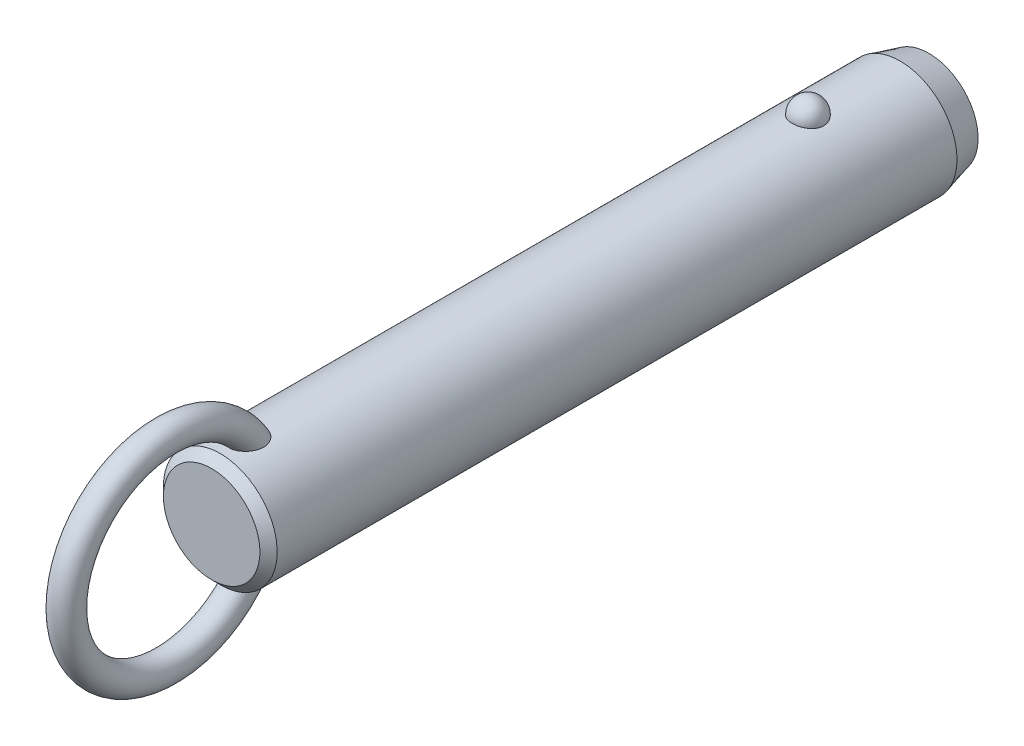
ISO-10303-21;
HEADER;
FILE_DESCRIPTION(('STEP AP214'),'2;1');
FILE_NAME('part.step','',(''),(''),'','','');
FILE_SCHEMA(('AUTOMOTIVE_DESIGN { 1 0 10303 214 1 1 1 1 }'));
ENDSEC;
DATA;
#1=APPLICATION_CONTEXT('core data for automotive mechanical design processes');
#2=APPLICATION_PROTOCOL_DEFINITION('international standard','automotive_design',2000,#1);
#3=PRODUCT_CONTEXT('',#1,'mechanical');
#4=PRODUCT('Part','Part','',(#3));
#5=PRODUCT_RELATED_PRODUCT_CATEGORY('part','',(#4));
#6=PRODUCT_DEFINITION_FORMATION('','',#4);
#7=PRODUCT_DEFINITION_CONTEXT('part definition',#1,'design');
#8=PRODUCT_DEFINITION('design','',#6,#7);
#9=PRODUCT_DEFINITION_SHAPE('','',#8);
#10=(LENGTH_UNIT() NAMED_UNIT(*) SI_UNIT(.MILLI.,.METRE.));
#11=(NAMED_UNIT(*) PLANE_ANGLE_UNIT() SI_UNIT($,.RADIAN.));
#12=(NAMED_UNIT(*) SI_UNIT($,.STERADIAN.) SOLID_ANGLE_UNIT());
#13=UNCERTAINTY_MEASURE_WITH_UNIT(LENGTH_MEASURE(1.E-05),#10,'distance_accuracy_value','');
#14=(GEOMETRIC_REPRESENTATION_CONTEXT(3) GLOBAL_UNCERTAINTY_ASSIGNED_CONTEXT((#13)) GLOBAL_UNIT_ASSIGNED_CONTEXT((#10,
#11,#12)) REPRESENTATION_CONTEXT('',''));
#15=CARTESIAN_POINT('',(0.,0.,0.));
#16=DIRECTION('',(0.,0.,1.));
#17=DIRECTION('',(1.,0.,0.));
#18=AXIS2_PLACEMENT_3D('',#15,#16,#17);
#19=CARTESIAN_POINT('',(0.,0.,71.1));
#20=DIRECTION('',(0.,0.,-1.));
#21=DIRECTION('',(-1.,0.,0.));
#22=AXIS2_PLACEMENT_3D('',#19,#20,#21);
#23=CYLINDRICAL_SURFACE('',#22,7.9);
#24=CARTESIAN_POINT('',(2.1785689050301,7.59367088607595,-2.19999999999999));
#25=CARTESIAN_POINT('',(2.17856679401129,7.59367269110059,-2.07701843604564));
#26=CARTESIAN_POINT('',(2.16853481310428,7.59657145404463,-1.95401006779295));
#27=CARTESIAN_POINT('',(2.12864689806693,7.607843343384,-1.71147811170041));
#28=CARTESIAN_POINT('',(2.09878338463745,7.61621856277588,-1.59195587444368));
#29=CARTESIAN_POINT('',(2.0199931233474,7.63749180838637,-1.3598563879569));
#30=CARTESIAN_POINT('',(1.97107475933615,7.6503878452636,-1.24727610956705));
#31=CARTESIAN_POINT('',(1.85539377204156,7.67926115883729,-1.03213234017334));
#32=CARTESIAN_POINT('',(1.78863158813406,7.69523835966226,-0.929568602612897));
#33=CARTESIAN_POINT('',(1.63856494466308,7.7285848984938,-0.736786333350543));
#34=CARTESIAN_POINT('',(1.55518140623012,7.7459606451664,-0.646630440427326));
#35=CARTESIAN_POINT('',(1.37422937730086,7.78009978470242,-0.481747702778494));
#36=CARTESIAN_POINT('',(1.27666086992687,7.79686317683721,-0.407020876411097));
#37=CARTESIAN_POINT('',(1.07024728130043,7.82786153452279,-0.275278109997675));
#38=CARTESIAN_POINT('',(0.961434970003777,7.84210353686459,-0.218212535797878));
#39=CARTESIAN_POINT('',(0.735351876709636,7.86652194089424,-0.123146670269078));
#40=CARTESIAN_POINT('',(0.618082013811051,7.87669878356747,-0.085144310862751));
#41=CARTESIAN_POINT('',(0.380637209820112,7.89170521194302,-0.0298158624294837));
#42=CARTESIAN_POINT('',(0.260550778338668,7.89662650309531,-0.0121347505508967));
#43=CARTESIAN_POINT('',(0.0190117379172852,7.90090003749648,0.00324379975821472));
#44=CARTESIAN_POINT('',(-0.102440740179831,7.90025280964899,0.00094313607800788));
#45=CARTESIAN_POINT('',(-0.341452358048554,7.89351056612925,-0.0233955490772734));
#46=CARTESIAN_POINT('',(-0.459042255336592,7.88749257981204,-0.0451545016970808));
#47=CARTESIAN_POINT('',(-0.688796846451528,7.87075812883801,-0.107408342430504));
#48=CARTESIAN_POINT('',(-0.800961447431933,7.86004158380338,-0.147903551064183));
#49=CARTESIAN_POINT('',(-1.01743634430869,7.83497131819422,-0.246799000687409));
#50=CARTESIAN_POINT('',(-1.12169791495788,7.82059709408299,-0.305300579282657));
#51=CARTESIAN_POINT('',(-1.31891765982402,7.78976470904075,-0.438549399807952));
#52=CARTESIAN_POINT('',(-1.41187469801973,7.77330633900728,-0.513298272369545));
#53=CARTESIAN_POINT('',(-1.58577142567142,7.73972434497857,-0.678622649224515));
#54=CARTESIAN_POINT('',(-1.66645140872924,7.72259402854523,-0.769470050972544));
#55=CARTESIAN_POINT('',(-1.81161503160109,7.68983776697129,-0.963538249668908));
#56=CARTESIAN_POINT('',(-1.87609753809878,7.6742119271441,-1.06675991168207));
#57=CARTESIAN_POINT('',(-1.98790138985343,7.6460202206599,-1.28401170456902));
#58=CARTESIAN_POINT('',(-2.03501994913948,7.63349104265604,-1.39815107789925));
#59=CARTESIAN_POINT('',(-2.10986724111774,7.6131449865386,-1.63301784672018));
#60=CARTESIAN_POINT('',(-2.1375965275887,7.60532797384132,-1.75374505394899));
#61=CARTESIAN_POINT('',(-2.17289256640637,7.5953195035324,-1.99782562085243));
#62=CARTESIAN_POINT('',(-2.18054294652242,7.59310471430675,-2.12116592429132));
#63=CARTESIAN_POINT('',(-2.17572919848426,7.59448538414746,-2.36741799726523));
#64=CARTESIAN_POINT('',(-2.1632656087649,7.59808068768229,-2.49032977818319));
#65=CARTESIAN_POINT('',(-2.11865035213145,7.61064035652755,-2.73161015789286));
#66=CARTESIAN_POINT('',(-2.08659579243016,7.61957823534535,-2.84999812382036));
#67=CARTESIAN_POINT('',(-2.00367799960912,7.64179982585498,-3.07955956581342));
#68=CARTESIAN_POINT('',(-1.9528140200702,7.65508371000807,-3.19073275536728));
#69=CARTESIAN_POINT('',(-1.83321113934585,7.68460381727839,-3.40337899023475));
#70=CARTESIAN_POINT('',(-1.76437735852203,7.70085556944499,-3.50479651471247));
#71=CARTESIAN_POINT('',(-1.61069526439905,7.73445734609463,-3.69446912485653));
#72=CARTESIAN_POINT('',(-1.52584634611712,7.75180741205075,-3.78272371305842));
#73=CARTESIAN_POINT('',(-1.34198059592,7.78574608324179,-3.94393987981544));
#74=CARTESIAN_POINT('',(-1.24291308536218,7.80233167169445,-4.01684434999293));
#75=CARTESIAN_POINT('',(-1.03352039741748,7.83281625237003,-4.14489386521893));
#76=CARTESIAN_POINT('',(-0.92319600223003,7.84671543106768,-4.20004014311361));
#77=CARTESIAN_POINT('',(-0.695822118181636,7.87011575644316,-4.29042017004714));
#78=CARTESIAN_POINT('',(-0.578872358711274,7.87966903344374,-4.32589112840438));
#79=CARTESIAN_POINT('',(-0.340410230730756,7.8935652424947,-4.37692226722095));
#80=CARTESIAN_POINT('',(-0.218898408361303,7.89790879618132,-4.39248482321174));
#81=CARTESIAN_POINT('',(0.0228107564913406,7.90087453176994,-4.40314405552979));
#82=CARTESIAN_POINT('',(0.142990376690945,7.89960185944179,-4.39861683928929));
#83=CARTESIAN_POINT('',(0.380829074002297,7.89171262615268,-4.37008293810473));
#84=CARTESIAN_POINT('',(0.498488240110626,7.8850962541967,-4.34607694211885));
#85=CARTESIAN_POINT('',(0.727535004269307,7.86726442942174,-4.27939317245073));
#86=CARTESIAN_POINT('',(0.838944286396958,7.85606616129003,-4.236785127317));
#87=CARTESIAN_POINT('',(1.05295421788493,7.83025654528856,-4.13408348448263));
#88=CARTESIAN_POINT('',(1.15555431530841,7.81564498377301,-4.07398879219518));
#89=CARTESIAN_POINT('',(1.35076763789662,7.7843022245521,-3.93687432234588));
#90=CARTESIAN_POINT('',(1.4432046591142,7.76754209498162,-3.85961036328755));
#91=CARTESIAN_POINT('',(1.6139111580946,7.73387857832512,-3.69076949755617));
#92=CARTESIAN_POINT('',(1.6921781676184,7.71697516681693,-3.59919010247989));
#93=CARTESIAN_POINT('',(1.83380875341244,7.6845643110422,-3.40247278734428));
#94=CARTESIAN_POINT('',(1.89689280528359,7.66908588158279,-3.29712873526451));
#95=CARTESIAN_POINT('',(2.0047823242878,7.64159441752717,-3.07707931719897));
#96=CARTESIAN_POINT('',(2.0495945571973,7.62958010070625,-2.96237743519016));
#97=CARTESIAN_POINT('',(2.11580183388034,7.61146617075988,-2.74040519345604));
#98=CARTESIAN_POINT('',(2.13929812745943,7.60484503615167,-2.63379846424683));
#99=CARTESIAN_POINT('',(2.17068242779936,7.59594664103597,-2.41813481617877));
#100=CARTESIAN_POINT('',(2.17857077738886,7.59366928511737,-2.30907795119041));
#101=CARTESIAN_POINT('',(2.1785689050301,7.59367088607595,-2.19999999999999));
#102=B_SPLINE_CURVE_WITH_KNOTS('',3,(#24,#25,#26,#27,#28,#29,#30,#31,#32,#33,#34,#35,#36,#37,
#38,#39,#40,#41,#42,#43,#44,#45,#46,#47,#48,#49,#50,#51,#52,#53,#54,#55,#56,#57,#58,#59,#60,#61,
#62,#63,#64,#65,#66,#67,#68,#69,#70,#71,#72,#73,#74,#75,#76,#77,#78,#79,#80,#81,#82,#83,#84,#85,
#86,#87,#88,#89,#90,#91,#92,#93,#94,#95,#96,#97,#98,#99,#100,#101),.UNSPECIFIED.,.T.,.F.,(4,2,2,
2,2,2,2,2,2,2,2,2,2,2,2,2,2,2,2,2,2,2,2,2,2,2,2,2,2,2,2,2,2,2,2,2,2,2,4),(0.,0.368552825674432,
0.737246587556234,1.10577831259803,1.4743009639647,1.8446206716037,2.21494081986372,
2.5842105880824,2.95344028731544,3.31611630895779,3.67875788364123,4.03628044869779,
4.39380913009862,4.75338791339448,5.11300280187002,5.47939989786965,5.8458226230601,
6.21639834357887,6.58696347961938,6.95598276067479,7.32499216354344,7.69218715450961,
8.0593967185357,8.42858578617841,8.79778880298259,9.16834203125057,9.5388695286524,
9.90482699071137,10.2707407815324,10.6298333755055,10.9889132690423,11.3466585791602,
11.7044262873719,12.0676511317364,12.4309391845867,12.8004764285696,13.1698767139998,
13.4967701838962,13.8236564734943),.UNSPECIFIED.);
#103=CARTESIAN_POINT('',(2.1785689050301,7.59367088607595,-2.19999999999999));
#104=VERTEX_POINT('',#103);
#105=EDGE_CURVE('E41',#104,#104,#102,.T.);
#106=ORIENTED_EDGE('',*,*,#105,.T.);
#107=EDGE_LOOP('',(#106));
#108=FACE_BOUND('',#107,.T.);
#109=CARTESIAN_POINT('',(0.,0.,79.42));
#110=DIRECTION('',(0.,0.,1.));
#111=DIRECTION('',(1.,0.,0.));
#112=AXIS2_PLACEMENT_3D('',#109,#110,#111);
#113=CIRCLE('',#112,7.9);
#114=CARTESIAN_POINT('',(-7.90000000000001,0.,79.42));
#115=VERTEX_POINT('',#114);
#116=EDGE_CURVE('E10',#115,#115,#113,.F.);
#117=ORIENTED_EDGE('',*,*,#116,.T.);
#118=EDGE_LOOP('',(#117));
#119=FACE_BOUND('',#118,.T.);
#120=CARTESIAN_POINT('',(-0.630969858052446,-7.87476203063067,73.3124322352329));
#121=CARTESIAN_POINT('',(-0.73418033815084,-7.8664899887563,73.347285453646));
#122=CARTESIAN_POINT('',(-0.834476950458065,-7.85639291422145,73.3908160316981));
#123=CARTESIAN_POINT('',(-1.02620356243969,-7.83366343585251,73.494094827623));
#124=CARTESIAN_POINT('',(-1.1176141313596,-7.82102565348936,73.5538775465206));
#125=CARTESIAN_POINT('',(-1.28877277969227,-7.79464922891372,73.6878390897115));
#126=CARTESIAN_POINT('',(-1.36854014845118,-7.78091246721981,73.761993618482));
#127=CARTESIAN_POINT('',(-1.5146152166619,-7.75380398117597,73.9224941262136));
#128=CARTESIAN_POINT('',(-1.58092966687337,-7.74043207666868,74.0088339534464));
#129=CARTESIAN_POINT('',(-1.70019064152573,-7.71512522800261,74.1929784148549));
#130=CARTESIAN_POINT('',(-1.75284037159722,-7.70322473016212,74.2909792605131));
#131=CARTESIAN_POINT('',(-1.84263464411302,-7.68224112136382,74.4941029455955));
#132=CARTESIAN_POINT('',(-1.87977299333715,-7.6731591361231,74.5992286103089));
#133=CARTESIAN_POINT('',(-1.94152728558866,-7.65777930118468,74.8232849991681));
#134=CARTESIAN_POINT('',(-1.96475471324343,-7.65179654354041,74.9426167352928));
#135=CARTESIAN_POINT('',(-1.99449499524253,-7.64409642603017,75.1834298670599));
#136=CARTESIAN_POINT('',(-2.0010005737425,-7.64238092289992,75.3049121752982));
#137=CARTESIAN_POINT('',(-1.99856014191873,-7.64302120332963,75.5683409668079));
#138=CARTESIAN_POINT('',(-1.98680021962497,-7.64611845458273,75.7102565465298));
#139=CARTESIAN_POINT('',(-1.94457772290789,-7.65696186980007,75.9911188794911));
#140=CARTESIAN_POINT('',(-1.91409393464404,-7.66471330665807,76.1300620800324));
#141=CARTESIAN_POINT('',(-1.82768670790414,-7.68582947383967,76.431939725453));
#142=CARTESIAN_POINT('',(-1.76772963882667,-7.70003779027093,76.593686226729));
#143=CARTESIAN_POINT('',(-1.65998501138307,-7.72371550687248,76.8276956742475));
#144=CARTESIAN_POINT('',(-1.621079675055,-7.73200670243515,76.9042974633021));
#145=CARTESIAN_POINT('',(-1.53727726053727,-7.74910377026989,77.0540798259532));
#146=CARTESIAN_POINT('',(-1.49238215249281,-7.75790947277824,77.1272615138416));
#147=CARTESIAN_POINT('',(-1.3739705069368,-7.77993338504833,77.3028838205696));
#148=CARTESIAN_POINT('',(-1.29690364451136,-7.79328473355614,77.4029557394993));
#149=CARTESIAN_POINT('',(-1.1288548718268,-7.81939266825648,77.5907147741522));
#150=CARTESIAN_POINT('',(-1.03789926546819,-7.83215032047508,77.6784247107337));
#151=CARTESIAN_POINT('',(-0.869532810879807,-7.85231710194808,77.8134148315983));
#152=CARTESIAN_POINT('',(-0.795716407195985,-7.86021093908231,77.865076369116));
#153=CARTESIAN_POINT('',(-0.64081313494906,-7.87434920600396,77.9563815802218));
#154=CARTESIAN_POINT('',(-0.55973779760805,-7.88059619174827,77.9960438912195));
#155=CARTESIAN_POINT('',(-0.406456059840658,-7.88984116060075,78.0543008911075));
#156=CARTESIAN_POINT('',(-0.335227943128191,-7.89321892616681,78.0753848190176));
#157=CARTESIAN_POINT('',(-0.19019307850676,-7.89804235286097,78.1054141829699));
#158=CARTESIAN_POINT('',(-0.11638863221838,-7.89948969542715,78.1143701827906));
#159=CARTESIAN_POINT('',(0.0318414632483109,-7.90028409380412,78.1192915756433));
#160=CARTESIAN_POINT('',(0.106268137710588,-7.89962640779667,78.1152276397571));
#161=CARTESIAN_POINT('',(0.253290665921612,-7.8962818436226,78.0944615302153));
#162=CARTESIAN_POINT('',(0.32588518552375,-7.8935935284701,78.0777504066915));
#163=CARTESIAN_POINT('',(0.481441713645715,-7.88577340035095,78.0287380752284));
#164=CARTESIAN_POINT('',(0.563611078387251,-7.88026321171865,77.994005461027));
#165=CARTESIAN_POINT('',(0.721129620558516,-7.86741729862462,77.9117965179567));
#166=CARTESIAN_POINT('',(0.796466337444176,-7.86007832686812,77.864297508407));
#167=CARTESIAN_POINT('',(0.971456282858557,-7.84073285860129,77.736513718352));
#168=CARTESIAN_POINT('',(1.0671968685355,-7.82809461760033,77.6510047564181));
#169=CARTESIAN_POINT('',(1.24418921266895,-7.80192439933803,77.466232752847));
#170=CARTESIAN_POINT('',(1.32540832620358,-7.78839049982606,77.3669395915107));
#171=CARTESIAN_POINT('',(1.45199971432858,-7.76559693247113,77.1895760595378));
#172=CARTESIAN_POINT('',(1.50085649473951,-7.75626094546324,77.1139542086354));
#173=CARTESIAN_POINT('',(1.59197749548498,-7.7380727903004,76.9587428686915));
#174=CARTESIAN_POINT('',(1.63423919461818,-7.72922080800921,76.8791518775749));
#175=CARTESIAN_POINT('',(1.71222612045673,-7.71231959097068,76.7166640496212));
#176=CARTESIAN_POINT('',(1.74794516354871,-7.70427111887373,76.6337641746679));
#177=CARTESIAN_POINT('',(1.81270113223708,-7.68929240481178,76.4652967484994));
#178=CARTESIAN_POINT('',(1.84173789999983,-7.68236218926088,76.3797291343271));
#179=CARTESIAN_POINT('',(1.89322698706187,-7.66983757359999,76.2052870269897));
#180=CARTESIAN_POINT('',(1.91558744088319,-7.66426199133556,76.1163838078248));
#181=CARTESIAN_POINT('',(1.95281367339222,-7.65485915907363,75.9369696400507));
#182=CARTESIAN_POINT('',(1.96767946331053,-7.65103190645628,75.8464586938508));
#183=CARTESIAN_POINT('',(2.00021456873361,-7.64262981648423,75.5737320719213));
#184=CARTESIAN_POINT('',(2.00600691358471,-7.6410871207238,75.3897099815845));
#185=CARTESIAN_POINT('',(1.98445334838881,-7.64669564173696,75.0765019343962));
#186=CARTESIAN_POINT('',(1.96607186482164,-7.65149688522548,74.9466189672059));
#187=CARTESIAN_POINT('',(1.90884967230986,-7.6659762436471,74.6916321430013));
#188=CARTESIAN_POINT('',(1.8700210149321,-7.67565148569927,74.566525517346));
#189=CARTESIAN_POINT('',(1.77063986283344,-7.69918471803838,74.3245401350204));
#190=CARTESIAN_POINT('',(1.70993724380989,-7.71307150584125,74.2077250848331));
#191=CARTESIAN_POINT('',(1.5673307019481,-7.74330306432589,73.9881444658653));
#192=CARTESIAN_POINT('',(1.48543692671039,-7.75964665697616,73.8853722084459));
#193=CARTESIAN_POINT('',(1.31346177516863,-7.79047523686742,73.7093800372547));
#194=CARTESIAN_POINT('',(1.22547278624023,-7.80495298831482,73.6341066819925));
#195=CARTESIAN_POINT('',(1.03724352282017,-7.83218597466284,73.5004864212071));
#196=CARTESIAN_POINT('',(0.937008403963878,-7.84494192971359,73.4421324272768));
#197=CARTESIAN_POINT('',(0.733599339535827,-7.86649045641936,73.3470270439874));
#198=CARTESIAN_POINT('',(0.630941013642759,-7.87547134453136,73.3092109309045));
#199=CARTESIAN_POINT('',(0.420465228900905,-7.88950708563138,73.2511160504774));
#200=CARTESIAN_POINT('',(0.312645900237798,-7.89456050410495,73.2308436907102));
#201=CARTESIAN_POINT('',(0.0960869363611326,-7.9001518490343,73.2084559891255));
#202=CARTESIAN_POINT('',(-0.0126341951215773,-7.90073226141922,73.2061698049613));
#203=CARTESIAN_POINT('',(-0.228766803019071,-7.89742350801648,73.2193678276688));
#204=CARTESIAN_POINT('',(-0.336180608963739,-7.89354403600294,73.2348134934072));
#205=CARTESIAN_POINT('',(-0.473410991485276,-7.88586871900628,73.2662177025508));
#206=CARTESIAN_POINT('',(-0.50525779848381,-7.88388984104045,73.2743541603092));
#207=CARTESIAN_POINT('',(-0.5684812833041,-7.87958326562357,73.2922083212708));
#208=CARTESIAN_POINT('',(-0.599857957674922,-7.87725556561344,73.3019260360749));
#209=CARTESIAN_POINT('',(-0.630969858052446,-7.87476203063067,73.3124322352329));
#210=B_SPLINE_CURVE_WITH_KNOTS('',3,(#120,#121,#122,#123,#124,#125,#126,#127,#128,#129,#130,
#131,#132,#133,#134,#135,#136,#137,#138,#139,#140,#141,#142,#143,#144,#145,#146,#147,#148,#149,
#150,#151,#152,#153,#154,#155,#156,#157,#158,#159,#160,#161,#162,#163,#164,#165,#166,#167,#168,
#169,#170,#171,#172,#173,#174,#175,#176,#177,#178,#179,#180,#181,#182,#183,#184,#185,#186,#187,
#188,#189,#190,#191,#192,#193,#194,#195,#196,#197,#198,#199,#200,#201,#202,#203,#204,#205,#206,
#207,#208,#209),.UNSPECIFIED.,.T.,.F.,(4,2,2,2,2,2,2,2,2,2,2,2,2,2,2,2,2,2,2,2,2,2,2,2,2,2,2,2,
2,2,2,2,2,2,2,2,2,2,2,2,2,2,2,2,4),(0.,0.327622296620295,0.655945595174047,0.983718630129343,
1.3113267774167,1.64554655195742,1.9798996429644,2.3436572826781,2.70757317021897,
3.13333684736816,3.55958380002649,4.07655306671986,4.3352789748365,4.59391999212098,
4.97382437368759,5.35301797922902,5.62348245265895,5.89352465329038,6.11565959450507,
6.3376009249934,6.56004255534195,6.78264174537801,7.04930844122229,7.31645206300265,
7.70130871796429,8.08701995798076,8.35824509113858,8.62957365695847,8.90115735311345,
9.17274746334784,9.44791855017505,9.72308922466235,10.2715298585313,10.6638393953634,
11.0559179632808,11.4507403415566,11.845374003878,12.1936425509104,12.5417649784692,
12.8695063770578,13.1973674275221,13.5221104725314,13.8461490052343,13.9449071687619,
14.0436660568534),.UNSPECIFIED.);
#211=CARTESIAN_POINT('',(-0.630969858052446,-7.87476203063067,73.3124322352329));
#212=VERTEX_POINT('',#211);
#213=EDGE_CURVE('E59',#212,#212,#210,.T.);
#214=ORIENTED_EDGE('',*,*,#213,.T.);
#215=EDGE_LOOP('',(#214));
#216=FACE_BOUND('',#215,.T.);
#217=CARTESIAN_POINT('',(-0.630969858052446,7.87476203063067,73.3124322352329));
#218=CARTESIAN_POINT('',(-0.528918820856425,7.88293636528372,73.2779798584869));
#219=CARTESIAN_POINT('',(-0.423745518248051,7.8893481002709,73.251915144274));
#220=CARTESIAN_POINT('',(-0.210236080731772,7.8979273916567,73.2172825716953));
#221=CARTESIAN_POINT('',(-0.10189380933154,7.90008607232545,73.2087513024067));
#222=CARTESIAN_POINT('',(0.114660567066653,7.89990877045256,73.2094570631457));
#223=CARTESIAN_POINT('',(0.222872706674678,7.89757640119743,73.2186798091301));
#224=CARTESIAN_POINT('',(0.436107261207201,7.88867538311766,73.2546525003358));
#225=CARTESIAN_POINT('',(0.541131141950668,7.8821087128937,73.2813942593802));
#226=CARTESIAN_POINT('',(0.745085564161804,7.86545130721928,73.3517561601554));
#227=CARTESIAN_POINT('',(0.844015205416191,7.85536005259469,73.3953787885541));
#228=CARTESIAN_POINT('',(1.03299167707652,7.83275153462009,73.4983796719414));
#229=CARTESIAN_POINT('',(1.12303841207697,7.8202342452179,73.5577580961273));
#230=CARTESIAN_POINT('',(1.29214734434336,7.79408219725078,73.6908647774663));
#231=CARTESIAN_POINT('',(1.37116907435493,7.78044359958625,73.7646436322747));
#232=CARTESIAN_POINT('',(1.51597677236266,7.75353170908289,73.9242353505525));
#233=CARTESIAN_POINT('',(1.58176261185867,7.74025841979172,74.0100483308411));
#234=CARTESIAN_POINT('',(1.70057386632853,7.71504069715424,74.193644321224));
#235=CARTESIAN_POINT('',(1.75320073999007,7.70314257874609,74.2916906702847));
#236=CARTESIAN_POINT('',(1.84293767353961,7.68216822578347,74.4948931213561));
#237=CARTESIAN_POINT('',(1.88004278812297,7.67309289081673,74.6000514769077));
#238=CARTESIAN_POINT('',(1.9417232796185,7.6577294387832,74.8241671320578));
#239=CARTESIAN_POINT('',(1.96491037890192,7.65175648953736,74.9435248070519));
#240=CARTESIAN_POINT('',(1.9945689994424,7.64407702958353,75.1843848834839));
#241=CARTESIAN_POINT('',(2.00103304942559,7.64237242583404,75.3058882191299));
#242=CARTESIAN_POINT('',(1.9985016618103,7.64303650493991,75.5693688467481));
#243=CARTESIAN_POINT('',(1.98669038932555,7.64614714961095,75.7113141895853));
#244=CARTESIAN_POINT('',(1.94436120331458,7.6570170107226,75.9922287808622));
#245=CARTESIAN_POINT('',(1.91382203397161,7.66478150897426,76.1311944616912));
#246=CARTESIAN_POINT('',(1.82728754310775,7.68592483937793,76.4331110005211));
#247=CARTESIAN_POINT('',(1.76725778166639,7.7001468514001,76.594872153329));
#248=CARTESIAN_POINT('',(1.65939700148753,7.72384204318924,76.8288914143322));
#249=CARTESIAN_POINT('',(1.62045187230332,7.73213852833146,76.9054942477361));
#250=CARTESIAN_POINT('',(1.53656684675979,7.74924489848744,77.0552737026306));
#251=CARTESIAN_POINT('',(1.49162892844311,7.75805461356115,77.1284514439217));
#252=CARTESIAN_POINT('',(1.37317698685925,7.78007342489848,77.3039520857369));
#253=CARTESIAN_POINT('',(1.29612360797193,7.79341423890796,77.4039112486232));
#254=CARTESIAN_POINT('',(1.12812043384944,7.81949839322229,77.5914508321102));
#255=CARTESIAN_POINT('',(1.03719688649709,7.83224280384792,77.6790540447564));
#256=CARTESIAN_POINT('',(0.868871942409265,7.85239026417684,77.8138971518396));
#257=CARTESIAN_POINT('',(0.795056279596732,7.86027769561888,77.8655113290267));
#258=CARTESIAN_POINT('',(0.640160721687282,7.87440222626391,77.9567201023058));
#259=CARTESIAN_POINT('',(0.559092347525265,7.88064188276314,77.9963333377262));
#260=CARTESIAN_POINT('',(0.405820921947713,7.8898738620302,78.0545056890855));
#261=CARTESIAN_POINT('',(0.334594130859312,7.89324577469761,78.0755523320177));
#262=CARTESIAN_POINT('',(0.189568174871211,7.89805733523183,78.1055070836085));
#263=CARTESIAN_POINT('',(0.115771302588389,7.89949866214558,78.1144257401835));
#264=CARTESIAN_POINT('',(-0.0324359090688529,7.90028156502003,78.1192758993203));
#265=CARTESIAN_POINT('',(-0.106847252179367,7.89961843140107,78.1151782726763));
#266=CARTESIAN_POINT('',(-0.253834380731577,7.8962642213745,78.0943519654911));
#267=CARTESIAN_POINT('',(-0.326408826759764,7.89357170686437,78.0776143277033));
#268=CARTESIAN_POINT('',(-0.481962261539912,7.88574179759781,78.0285391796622));
#269=CARTESIAN_POINT('',(-0.564145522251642,7.88022507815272,77.9937638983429));
#270=CARTESIAN_POINT('',(-0.721685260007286,7.86736646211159,77.9114686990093));
#271=CARTESIAN_POINT('',(-0.797029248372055,7.8600213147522,77.8639260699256));
#272=CARTESIAN_POINT('',(-0.972044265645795,7.84066026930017,77.7360267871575));
#273=CARTESIAN_POINT('',(-1.06779803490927,7.82801274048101,77.6504436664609));
#274=CARTESIAN_POINT('',(-1.24480531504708,7.80182621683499,77.4655223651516));
#275=CARTESIAN_POINT('',(-1.32602618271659,7.78828530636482,77.3661540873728));
#276=CARTESIAN_POINT('',(-1.45259834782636,7.76548487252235,77.1886806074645));
#277=CARTESIAN_POINT('',(-1.50143856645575,7.75614818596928,77.1130252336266));
#278=CARTESIAN_POINT('',(-1.59252410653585,7.73796020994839,76.9577484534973));
#279=CARTESIAN_POINT('',(-1.63476690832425,7.72910910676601,76.8781255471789));
#280=CARTESIAN_POINT('',(-1.71271318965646,7.71221133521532,76.7155750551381));
#281=CARTESIAN_POINT('',(-1.74841047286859,7.70416543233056,76.6326444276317));
#282=CARTESIAN_POINT('',(-1.81311929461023,7.6891937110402,76.4641168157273));
#283=CARTESIAN_POINT('',(-1.84213067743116,7.6822679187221,76.3785197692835));
#284=CARTESIAN_POINT('',(-1.89356259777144,7.66975461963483,76.2040254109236));
#285=CARTESIAN_POINT('',(-1.91589165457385,7.66418586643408,76.1150995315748));
#286=CARTESIAN_POINT('',(-1.95305070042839,7.65479859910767,75.9356424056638));
#287=CARTESIAN_POINT('',(-1.96788069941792,7.65098008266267,75.8451111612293));
#288=CARTESIAN_POINT('',(-2.00030078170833,7.64260704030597,75.5723270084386));
#289=CARTESIAN_POINT('',(-2.00600576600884,7.64108760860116,75.3882718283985));
#290=CARTESIAN_POINT('',(-1.98428483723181,7.64673945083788,75.0750800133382));
#291=CARTESIAN_POINT('',(-1.96583698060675,7.6515575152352,74.9452400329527));
#292=CARTESIAN_POINT('',(-1.90848948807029,7.66606613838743,74.6903619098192));
#293=CARTESIAN_POINT('',(-1.86960376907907,7.67575338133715,74.565320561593));
#294=CARTESIAN_POINT('',(-1.7701342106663,7.69930132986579,74.3235009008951));
#295=CARTESIAN_POINT('',(-1.70940488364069,7.71318991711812,74.2067844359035));
#296=CARTESIAN_POINT('',(-1.56672953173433,7.74342495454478,73.9873404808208));
#297=CARTESIAN_POINT('',(-1.48478316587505,7.75977144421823,73.8846132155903));
#298=CARTESIAN_POINT('',(-1.31266325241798,7.79061163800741,73.708643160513));
#299=CARTESIAN_POINT('',(-1.22456383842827,7.80509908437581,73.6333589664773));
#300=CARTESIAN_POINT('',(-1.03622400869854,7.83231881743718,73.4998659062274));
#301=CARTESIAN_POINT('',(-0.936015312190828,7.84505551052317,73.4416137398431));
#302=CARTESIAN_POINT('',(-0.798824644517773,7.85957802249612,73.3775408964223));
#303=CARTESIAN_POINT('',(-0.765787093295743,7.86286821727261,73.3632248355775));
#304=CARTESIAN_POINT('',(-0.698939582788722,7.86909211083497,73.336436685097));
#305=CARTESIAN_POINT('',(-0.66512963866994,7.8720258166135,73.3239645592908));
#306=CARTESIAN_POINT('',(-0.630969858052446,7.87476203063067,73.3124322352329));
#307=B_SPLINE_CURVE_WITH_KNOTS('',3,(#217,#218,#219,#220,#221,#222,#223,#224,#225,#226,#227,
#228,#229,#230,#231,#232,#233,#234,#235,#236,#237,#238,#239,#240,#241,#242,#243,#244,#245,#246,
#247,#248,#249,#250,#251,#252,#253,#254,#255,#256,#257,#258,#259,#260,#261,#262,#263,#264,#265,
#266,#267,#268,#269,#270,#271,#272,#273,#274,#275,#276,#277,#278,#279,#280,#281,#282,#283,#284,
#285,#286,#287,#288,#289,#290,#291,#292,#293,#294,#295,#296,#297,#298,#299,#300,#301,#302,#303,
#304,#305,#306),.UNSPECIFIED.,.T.,.F.,(4,2,2,2,2,2,2,2,2,2,2,2,2,2,2,2,2,2,2,2,2,2,2,2,2,2,2,2,
2,2,2,2,2,2,2,2,2,2,2,2,2,2,2,2,4),(0.,0.323920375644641,0.648516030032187,0.97285063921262,
1.29703380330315,1.62126473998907,1.94549915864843,2.27089401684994,2.5962920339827,
2.93059633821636,3.26500707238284,3.62881644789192,3.99278833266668,4.41865421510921,
4.84500434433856,5.36209210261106,5.62087589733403,5.87957448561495,6.25918598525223,
6.63808782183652,6.90846748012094,7.17842501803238,7.40052350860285,7.62242871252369,
7.84483086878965,8.06739077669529,8.33414615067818,8.60137921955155,8.98641454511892,
9.3723041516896,9.64358673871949,9.91497268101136,10.1866142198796,10.4582620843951,
10.7334745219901,11.0086865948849,11.5572126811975,11.9494246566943,12.3413699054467,
12.7359755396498,13.1305875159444,13.4791770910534,13.82687259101,13.9353013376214,
14.0437279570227),.UNSPECIFIED.);
#308=CARTESIAN_POINT('',(-0.630969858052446,7.87476203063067,73.3124322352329));
#309=VERTEX_POINT('',#308);
#310=EDGE_CURVE('E66',#309,#309,#307,.T.);
#311=ORIENTED_EDGE('',*,*,#310,.T.);
#312=EDGE_LOOP('',(#311));
#313=FACE_BOUND('',#312,.T.);
#314=CARTESIAN_POINT('',(0.,0.,-14.9999999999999));
#315=DIRECTION('',(0.,0.,-1.));
#316=DIRECTION('',(-1.,0.,0.));
#317=AXIS2_PLACEMENT_3D('',#314,#315,#316);
#318=CIRCLE('',#317,7.9);
#319=CARTESIAN_POINT('',(-7.9,0.,-14.9999999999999));
#320=VERTEX_POINT('',#319);
#321=EDGE_CURVE('E56',#320,#320,#318,.F.);
#322=ORIENTED_EDGE('',*,*,#321,.T.);
#323=EDGE_LOOP('',(#322));
#324=FACE_BOUND('',#323,.T.);
#325=ADVANCED_FACE('F37',(#108,#119,#216,#313,#324),#23,.T.);
#326=CARTESIAN_POINT('',(0.,0.,-19.));
#327=DIRECTION('',(0.,0.,-1.));
#328=DIRECTION('',(-1.,0.,0.));
#329=AXIS2_PLACEMENT_3D('',#326,#327,#328);
#330=PLANE('',#329);
#331=CARTESIAN_POINT('',(0.,0.,-19.));
#332=DIRECTION('',(0.,0.,-1.));
#333=DIRECTION('',(-1.,0.,0.));
#334=AXIS2_PLACEMENT_3D('',#331,#332,#333);
#335=CIRCLE('',#334,6.82820323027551);
#336=CARTESIAN_POINT('',(-6.82820323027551,0.,-19.));
#337=VERTEX_POINT('',#336);
#338=EDGE_CURVE('E65',#337,#337,#335,.T.);
#339=ORIENTED_EDGE('',*,*,#338,.T.);
#340=EDGE_LOOP('',(#339));
#341=FACE_BOUND('',#340,.T.);
#342=ADVANCED_FACE('F84',(#341),#330,.T.);
#343=CARTESIAN_POINT('',(0.,0.,-19.));
#344=DIRECTION('',(0.,0.,1.));
#345=DIRECTION('',(1.,0.,0.));
#346=AXIS2_PLACEMENT_3D('',#343,#344,#345);
#347=CONICAL_SURFACE('',#346,6.82820323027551,0.261799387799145);
#348=ORIENTED_EDGE('',*,*,#321,.F.);
#349=EDGE_LOOP('',(#348));
#350=FACE_BOUND('',#349,.T.);
#351=ORIENTED_EDGE('',*,*,#338,.F.);
#352=EDGE_LOOP('',(#351));
#353=FACE_BOUND('',#352,.T.);
#354=ADVANCED_FACE('F82',(#350,#353),#347,.T.);
#355=CARTESIAN_POINT('',(0.,0.,80.62));
#356=DIRECTION('',(0.,0.,1.));
#357=DIRECTION('',(1.,0.,0.));
#358=AXIS2_PLACEMENT_3D('',#355,#356,#357);
#359=PLANE('',#358);
#360=CARTESIAN_POINT('',(0.,0.,80.62));
#361=DIRECTION('',(0.,0.,1.));
#362=DIRECTION('',(1.,0.,0.));
#363=AXIS2_PLACEMENT_3D('',#360,#361,#362);
#364=CIRCLE('',#363,6.69999999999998);
#365=CARTESIAN_POINT('',(-6.69999999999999,0.,80.62));
#366=VERTEX_POINT('',#365);
#367=EDGE_CURVE('E50',#366,#366,#364,.T.);
#368=ORIENTED_EDGE('',*,*,#367,.T.);
#369=EDGE_LOOP('',(#368));
#370=FACE_BOUND('',#369,.T.);
#371=ADVANCED_FACE('F76',(#370),#359,.T.);
#372=CARTESIAN_POINT('',(0.,0.,86.95));
#373=DIRECTION('',(1.,0.,0.));
#374=DIRECTION('',(0.,0.,-1.));
#375=AXIS2_PLACEMENT_3D('',#372,#373,#374);
#376=TOROIDAL_SURFACE('',#375,13.85,2.);
#377=ORIENTED_EDGE('',*,*,#310,.F.);
#378=EDGE_LOOP('',(#377));
#379=FACE_BOUND('',#378,.T.);
#380=ORIENTED_EDGE('',*,*,#213,.F.);
#381=EDGE_LOOP('',(#380));
#382=FACE_BOUND('',#381,.T.);
#383=ADVANCED_FACE('F72',(#379,#382),#376,.T.);
#384=CARTESIAN_POINT('',(0.,0.,80.62));
#385=DIRECTION('',(0.,0.,-1.));
#386=DIRECTION('',(-1.,0.,0.));
#387=AXIS2_PLACEMENT_3D('',#384,#385,#386);
#388=CONICAL_SURFACE('',#387,6.69999999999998,0.785398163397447);
#389=CARTESIAN_POINT('',(-7.90000000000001,0.,79.42));
#390=CARTESIAN_POINT('',(-7.88750000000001,0.,79.4325));
#391=CARTESIAN_POINT('',(-7.87500000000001,0.,79.445));
#392=CARTESIAN_POINT('',(-7.85,0.,79.47));
#393=CARTESIAN_POINT('',(-7.8375,0.,79.4825));
#394=CARTESIAN_POINT('',(-7.81250000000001,0.,79.5075));
#395=CARTESIAN_POINT('',(-7.80000000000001,0.,79.52));
#396=CARTESIAN_POINT('',(-7.77500000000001,0.,79.545));
#397=CARTESIAN_POINT('',(-7.76250000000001,0.,79.5575));
#398=CARTESIAN_POINT('',(-7.7375,0.,79.5825));
#399=CARTESIAN_POINT('',(-7.725,0.,79.595));
#400=CARTESIAN_POINT('',(-7.7,0.,79.62));
#401=CARTESIAN_POINT('',(-7.68750000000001,0.,79.6325));
#402=CARTESIAN_POINT('',(-7.66250000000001,0.,79.6575));
#403=CARTESIAN_POINT('',(-7.65,0.,79.67));
#404=CARTESIAN_POINT('',(-7.625,0.,79.695));
#405=CARTESIAN_POINT('',(-7.6125,0.,79.7075));
#406=CARTESIAN_POINT('',(-7.5875,0.,79.7325));
#407=CARTESIAN_POINT('',(-7.575,0.,79.745));
#408=CARTESIAN_POINT('',(-7.55,0.,79.77));
#409=CARTESIAN_POINT('',(-7.5375,0.,79.7825));
#410=CARTESIAN_POINT('',(-7.5125,0.,79.8075));
#411=CARTESIAN_POINT('',(-7.5,0.,79.82));
#412=CARTESIAN_POINT('',(-7.475,0.,79.845));
#413=CARTESIAN_POINT('',(-7.4625,0.,79.8575));
#414=CARTESIAN_POINT('',(-7.4375,0.,79.8825));
#415=CARTESIAN_POINT('',(-7.425,0.,79.895));
#416=CARTESIAN_POINT('',(-7.4,0.,79.92));
#417=CARTESIAN_POINT('',(-7.3875,0.,79.9325));
#418=CARTESIAN_POINT('',(-7.3625,0.,79.9575));
#419=CARTESIAN_POINT('',(-7.35,0.,79.97));
#420=CARTESIAN_POINT('',(-7.325,0.,79.995));
#421=CARTESIAN_POINT('',(-7.3125,0.,80.0075));
#422=CARTESIAN_POINT('',(-7.2875,0.,80.0325));
#423=CARTESIAN_POINT('',(-7.275,0.,80.045));
#424=CARTESIAN_POINT('',(-7.25,0.,80.07));
#425=CARTESIAN_POINT('',(-7.2375,0.,80.0825));
#426=CARTESIAN_POINT('',(-7.2125,0.,80.1075));
#427=CARTESIAN_POINT('',(-7.2,0.,80.12));
#428=CARTESIAN_POINT('',(-7.175,0.,80.145));
#429=CARTESIAN_POINT('',(-7.1625,0.,80.1575));
#430=CARTESIAN_POINT('',(-7.1375,0.,80.1825));
#431=CARTESIAN_POINT('',(-7.125,0.,80.195));
#432=CARTESIAN_POINT('',(-7.1,0.,80.22));
#433=CARTESIAN_POINT('',(-7.0875,0.,80.2325));
#434=CARTESIAN_POINT('',(-7.06249999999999,0.,80.2575));
#435=CARTESIAN_POINT('',(-7.04999999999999,0.,80.27));
#436=CARTESIAN_POINT('',(-7.02499999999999,0.,80.295));
#437=CARTESIAN_POINT('',(-7.0125,0.,80.3075));
#438=CARTESIAN_POINT('',(-6.9875,0.,80.3325));
#439=CARTESIAN_POINT('',(-6.975,0.,80.345));
#440=CARTESIAN_POINT('',(-6.94999999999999,0.,80.37));
#441=CARTESIAN_POINT('',(-6.93749999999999,0.,80.3825));
#442=CARTESIAN_POINT('',(-6.91249999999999,0.,80.4075));
#443=CARTESIAN_POINT('',(-6.9,0.,80.42));
#444=CARTESIAN_POINT('',(-6.87499999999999,0.,80.445));
#445=CARTESIAN_POINT('',(-6.86249999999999,0.,80.4575));
#446=CARTESIAN_POINT('',(-6.83749999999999,0.,80.4825));
#447=CARTESIAN_POINT('',(-6.82499999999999,0.,80.495));
#448=CARTESIAN_POINT('',(-6.79999999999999,0.,80.52));
#449=CARTESIAN_POINT('',(-6.78749999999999,0.,80.5325));
#450=CARTESIAN_POINT('',(-6.76249999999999,0.,80.5575));
#451=CARTESIAN_POINT('',(-6.74999999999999,0.,80.57));
#452=CARTESIAN_POINT('',(-6.72499999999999,0.,80.595));
#453=CARTESIAN_POINT('',(-6.71249999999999,0.,80.6075));
#454=CARTESIAN_POINT('',(-6.69999999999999,0.,80.62));
#455=B_SPLINE_CURVE_WITH_KNOTS('',3,(#389,#390,#391,#392,#393,#394,#395,#396,#397,#398,#399,
#400,#401,#402,#403,#404,#405,#406,#407,#408,#409,#410,#411,#412,#413,#414,#415,#416,#417,#418,
#419,#420,#421,#422,#423,#424,#425,#426,#427,#428,#429,#430,#431,#432,#433,#434,#435,#436,#437,
#438,#439,#440,#441,#442,#443,#444,#445,#446,#447,#448,#449,#450,#451,#452,#453,#454),
.UNSPECIFIED.,.F.,.F.,(4,2,2,2,2,2,2,2,2,2,2,2,2,2,2,2,2,2,2,2,2,2,2,2,2,2,2,2,2,2,2,2,4),(0.,
0.0530330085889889,0.106066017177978,0.159099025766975,0.212132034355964,0.265165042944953,
0.318198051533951,0.37123106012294,0.424264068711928,0.477297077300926,0.530330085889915,
0.583363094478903,0.636396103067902,0.68942911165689,0.742462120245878,0.795495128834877,
0.848528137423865,0.901561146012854,0.954594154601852,1.00762716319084,1.06066017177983,
1.11369318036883,1.16672618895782,1.2197591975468,1.2727922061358,1.32582521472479,
1.37885822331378,1.43189123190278,1.48492424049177,1.53795724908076,1.59099025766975,
1.64402326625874,1.69705627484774),.UNSPECIFIED.);
#456=EDGE_CURVE('BSEAM39',#115,#366,#455,.T.);
#457=ORIENTED_EDGE('',*,*,#116,.F.);
#458=ORIENTED_EDGE('',*,*,#367,.F.);
#459=ORIENTED_EDGE('',*,*,#456,.T.);
#460=ORIENTED_EDGE('',*,*,#456,.F.);
#461=EDGE_LOOP('',(#457,#459,#458,#460));
#462=FACE_BOUND('',#461,.T.);
#463=ADVANCED_FACE('F39',(#462),#388,.T.);
#464=CARTESIAN_POINT('',(0.,7.9,-2.19999999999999));
#465=DIRECTION('',(0.,1.,0.));
#466=DIRECTION('',(0.,0.,-1.));
#467=AXIS2_PLACEMENT_3D('',#464,#465,#466);
#468=SPHERICAL_SURFACE('',#467,2.2);
#469=ORIENTED_EDGE('',*,*,#105,.F.);
#470=EDGE_LOOP('',(#469));
#471=FACE_BOUND('',#470,.T.);
#472=ADVANCED_FACE('F78',(#471),#468,.T.);
#473=CLOSED_SHELL('',(#325,#342,#354,#371,#383,#463,#472));
#474=MANIFOLD_SOLID_BREP('B2',#473);
#475=ADVANCED_BREP_SHAPE_REPRESENTATION('',(#18,#474),#14);
#476=SHAPE_DEFINITION_REPRESENTATION(#9,#475);
ENDSEC;
END-ISO-10303-21;
